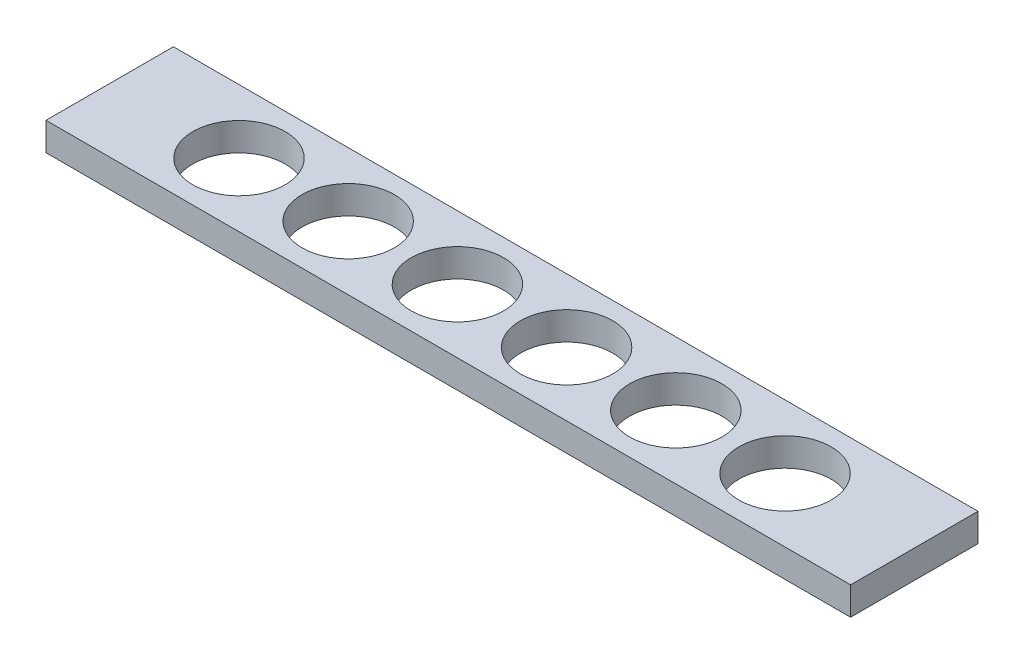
from build123d import *

# Parameters (mm, degrees)
SKETCH2_W      = 190.5
SKETCH2_H      = 31.75
SKETCH2_R      = 11.5
EXTRUDE1_DEPTH = 7
SKETCH3_W      = 5
SKETCH3_H      = 31.75
EXTRUDE2_DEPTH = 7


with BuildPart() as part:
    # Sketch2 → Extrude1 (new body)
    with BuildSketch(Plane(origin=(0, 0, 0), x_dir=(1, 0, 0), z_dir=(0, 1, 0))):
        with Locations((27.685549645, 5.922163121)):
            Rectangle(SKETCH2_W, SKETCH2_H)
        with Locations(Location((-40.350250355, 5.922163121, 0), (0, 0, 270))):
            Circle(SKETCH2_R, mode=Mode.SUBTRACT)
        with Locations(Location((-13.136050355, 5.922163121, 0), (0, 0, 270))):
            Circle(SKETCH2_R, mode=Mode.SUBTRACT)
        with Locations(Location((14.078149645, 5.922163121, 0), (0, 0, 270))):
            Circle(SKETCH2_R, mode=Mode.SUBTRACT)
        with Locations(Location((41.292949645, 5.922163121, 0), (0, 0, 270))):
            Circle(SKETCH2_R, mode=Mode.SUBTRACT)
        with Locations(Location((68.507149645, 5.922163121, 0), (0, 0, 270))):
            Circle(SKETCH2_R, mode=Mode.SUBTRACT)
        with Locations(Location((95.721349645, 5.922163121, 0), (0, 0, 270))):
            Circle(SKETCH2_R, mode=Mode.SUBTRACT)
    extrude(amount=EXTRUDE1_DEPTH)

    # Sketch3 → Extrude2 (add)
    with BuildSketch(Plane(origin=(0, 0, 0), x_dir=(1, 0, 0), z_dir=(0, 1, 0))):
        with Locations((-70.064450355, 5.922163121)):
            Rectangle(SKETCH3_W, SKETCH3_H)
        with Locations((125.435549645, 5.922163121)):
            Rectangle(SKETCH3_W, SKETCH3_H)
    extrude(amount=EXTRUDE2_DEPTH)


solid = part.part
